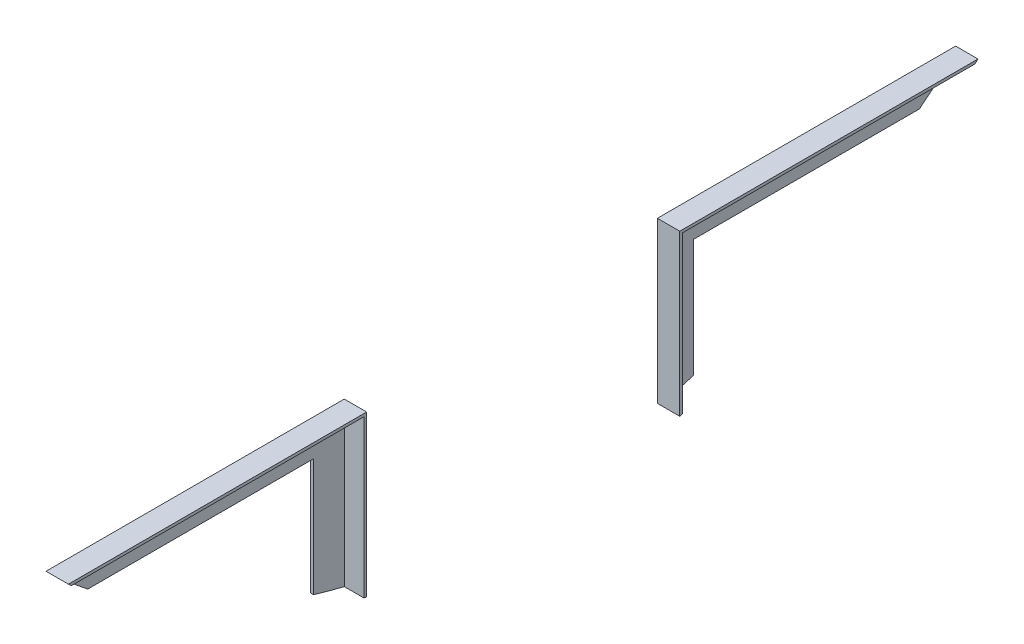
from build123d import *

# Parameters (mm, degrees)
BOSS_EXTRUDE1_DEPTH = 406.4
BOSS_EXTRUDE2_DEPTH = 711.2
CUT_EXTRUDE1_DEPTH  = 821.699116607


with BuildPart() as part:
    # Sketch1 → Boss-Extrude1 (new body)
    with BuildSketch(Plane(origin=(0, 0, 0), x_dir=(1, 0, 0), z_dir=(0, 1, 0))):
        Polygon((0, 76.2), (0, 0), (50.8, 0), (50.8, 6.35), (6.35, 6.35), (6.35, 76.2), align=None)
    extrude(amount=BOSS_EXTRUDE1_DEPTH)

    # Sketch3 → Boss-Extrude2 (add)
    with BuildSketch(Plane.XY):
        Polygon((50.8, 406.4), (0, 406.4), (0, 330.2), (6.35, 330.2), (6.35, 400.05), (50.8, 400.05), align=None)
    extrude(amount=-BOSS_EXTRUDE2_DEPTH)

    # Sketch4 → Cut-Extrude1 (cut, through all)
    with BuildSketch(Plane(origin=(0, 0, 0), x_dir=(0, 0, -1), z_dir=(1, 0, 0))):
        with BuildLine():
            Line((-355.6, 0), (1160.4625, 0))
            Line((1160.4625, 0), (1160.4625, 1516.0625))
            ThreePointArc((1160.4625, 1516.0625), (716.418074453, 444.044425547), (-355.6, 0))
        make_face()
    extrude(amount=CUT_EXTRUDE1_DEPTH, mode=Mode.SUBTRACT)


with BuildPart() as body_2:
    # Mirror3: mirrored copy
    add(part.part.mirror(Plane.XY.offset(355.6)))


solid = Compound([part.part, body_2.part])
